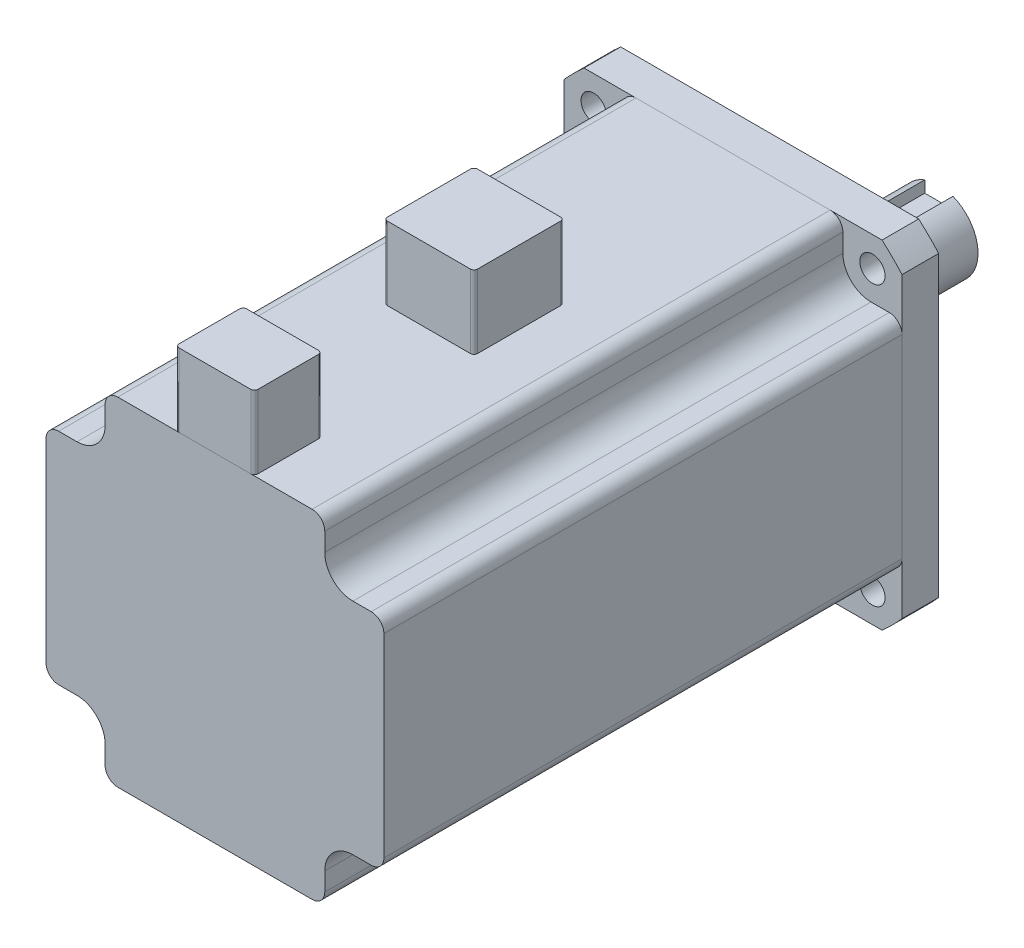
from build123d import *

# Parameters (mm, degrees)
SKETCH_1_R        = 2.25
EXTRUDE_1_DEPTH   = 6.5
SKETCH_2_R        = 25
EXTRUDE_2_DEPTH   = 3
EXTRUDE_3_DEPTH   = 27
EXTRUDE_4_DEPTH   = 92
EXTRUDE_5_DEPTH   = 13
EXTRUDE_5_2_DEPTH = 13


with BuildPart() as part:
    # Sketch 1 → Extrude 1 (new body)
    with BuildSketch(Plane.XY):
        with BuildLine():
            Line((-59.064382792, 2.814868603), (-111.979409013, 2.814868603))
            ThreePointArc((-111.979409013, 2.814868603), (-113.80616715, 1.099139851), (-115.521895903, -0.727618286))
            Line((-115.521895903, -0.727618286), (-115.521895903, -53.642644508))
            ThreePointArc((-115.521895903, -53.642644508), (-113.80616715, -55.469402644), (-111.979409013, -57.185131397))
            Line((-111.979409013, -57.185131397), (-59.064382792, -57.185131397))
            ThreePointArc((-59.064382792, -57.185131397), (-57.237624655, -55.469402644), (-55.521895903, -53.642644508))
            Line((-55.521895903, -53.642644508), (-55.521895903, -0.727618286))
            ThreePointArc((-55.521895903, -0.727618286), (-57.237624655, 1.099139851), (-59.064382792, 2.814868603))
        make_face()
        with Locations(Location((-110.270633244, -2.436394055, 0), (0, 0, 180))):
            Circle(SKETCH_1_R, mode=Mode.SUBTRACT)
        with Locations(Location((-60.773158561, -2.436394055, 0), (0, 0, 180))):
            Circle(SKETCH_1_R, mode=Mode.SUBTRACT)
        with Locations(Location((-60.773158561, -51.933868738, 0), (0, 0, 180))):
            Circle(SKETCH_1_R, mode=Mode.SUBTRACT)
        with Locations(Location((-110.270633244, -51.933868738, 0), (0, 0, 180))):
            Circle(SKETCH_1_R, mode=Mode.SUBTRACT)
    extrude(amount=EXTRUDE_1_DEPTH)

    # Sketch 2 → Extrude 2 (add)
    with BuildSketch(Plane(origin=(0, 0, 0), x_dir=(-1, 0, 0), z_dir=(0, 0, -1))):
        with Locations(Location((85.521895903, -27.185131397, 0), (0, 0, 180))):
            Circle(SKETCH_2_R)
    extrude(amount=EXTRUDE_2_DEPTH)

    # Sketch 3 → Extrude 3 (add)
    with BuildSketch(Plane(origin=(0, 0, -3), x_dir=(-1, 0, 0), z_dir=(0, 0, -1))):
        with BuildLine():
            Line((87.976441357, -20.629583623), (87.976441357, -22.685131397))
            Line((87.976441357, -22.685131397), (82.976441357, -22.685131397))
            Line((82.976441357, -22.685131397), (82.976441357, -20.664344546))
            ThreePointArc((82.976441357, -20.664344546), (85.570560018, -34.184962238), (87.976441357, -20.629583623))
        make_face()
    extrude(amount=EXTRUDE_3_DEPTH)


with BuildPart() as body_2:
    # Sketch 4 → Extrude 4 (new body)
    with BuildSketch(Plane.XY.offset(6.5)):
        with BuildLine():
            Line((-68.276175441, 2.814868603), (-102.767616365, 2.814868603))
            ThreePointArc((-102.767616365, 2.814868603), (-104.361632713, 2.154605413), (-105.021895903, 0.560589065))
            Line((-105.021895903, 0.560589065), (-105.021895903, -2.685131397))
            ThreePointArc((-105.021895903, -2.685131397), (-106.486361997, -6.220665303), (-110.021895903, -7.685131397))
            Line((-110.021895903, -7.685131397), (-113.267616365, -7.685131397))
            ThreePointArc((-113.267616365, -7.685131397), (-114.861632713, -8.345394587), (-115.521895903, -9.939410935))
            Line((-115.521895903, -9.939410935), (-115.521895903, -44.430851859))
            ThreePointArc((-115.521895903, -44.430851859), (-114.861632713, -46.024868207), (-113.267616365, -46.685131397))
            Line((-113.267616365, -46.685131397), (-110.021895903, -46.685131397))
            ThreePointArc((-110.021895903, -46.685131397), (-106.486361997, -48.149597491), (-105.021895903, -51.685131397))
            Line((-105.021895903, -51.685131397), (-105.021895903, -54.930851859))
            ThreePointArc((-105.021895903, -54.930851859), (-104.361632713, -56.524868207), (-102.767616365, -57.185131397))
            Line((-102.767616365, -57.185131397), (-68.276175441, -57.185131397))
            ThreePointArc((-68.276175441, -57.185131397), (-66.682159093, -56.524868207), (-66.021895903, -54.930851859))
            Line((-66.021895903, -54.930851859), (-66.021895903, -51.685131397))
            ThreePointArc((-66.021895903, -51.685131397), (-64.557429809, -48.149597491), (-61.021895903, -46.685131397))
            Line((-61.021895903, -46.685131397), (-57.776175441, -46.685131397))
            ThreePointArc((-57.776175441, -46.685131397), (-56.182159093, -46.024868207), (-55.521895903, -44.430851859))
            Line((-55.521895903, -44.430851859), (-55.521895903, -9.939410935))
            ThreePointArc((-55.521895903, -9.939410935), (-56.182159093, -8.345394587), (-57.776175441, -7.685131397))
            Line((-57.776175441, -7.685131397), (-61.021895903, -7.685131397))
            ThreePointArc((-61.021895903, -7.685131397), (-64.557429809, -6.220665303), (-66.021895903, -2.685131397))
            Line((-66.021895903, -2.685131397), (-66.021895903, 0.560589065))
            ThreePointArc((-66.021895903, 0.560589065), (-66.682159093, 2.154605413), (-68.276175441, 2.814868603))
        make_face()
    extrude(amount=EXTRUDE_4_DEPTH)


with BuildPart() as body_3:
    # Sketch 5 → Extrude 5 (new body)
    with BuildSketch(Plane(origin=(0, 2.814868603, 0), x_dir=(1, 0, 0), z_dir=(0, 1, 0))):
        with BuildLine():
            Line((-79.160412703, -86.5), (-91.883379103, -86.5))
            ThreePointArc((-91.883379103, -86.5), (-92.334878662, -86.687017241), (-92.521895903, -87.1385168))
            Line((-92.521895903, -87.1385168), (-92.521895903, -97.8614832))
            ThreePointArc((-92.521895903, -97.8614832), (-92.334878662, -98.312982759), (-91.883379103, -98.5))
            Line((-91.883379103, -98.5), (-79.160412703, -98.5))
            ThreePointArc((-79.160412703, -98.5), (-78.708913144, -98.312982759), (-78.521895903, -97.8614832))
            Line((-78.521895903, -97.8614832), (-78.521895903, -87.1385168))
            ThreePointArc((-78.521895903, -87.1385168), (-78.708913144, -86.687017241), (-79.160412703, -86.5))
        make_face()
    extrude(amount=EXTRUDE_5_DEPTH)


with BuildPart() as body_4:
    # Sketch 5 → Extrude 5 2 (new body)
    with BuildSketch(Plane(origin=(0, 2.814868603, 0), x_dir=(1, 0, 0), z_dir=(0, 1, 0))):
        with BuildLine():
            Line((-78.160412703, -44.5), (-92.883379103, -44.5))
            ThreePointArc((-92.883379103, -44.5), (-93.334878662, -44.687017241), (-93.521895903, -45.1385168))
            Line((-93.521895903, -45.1385168), (-93.521895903, -59.8614832))
            ThreePointArc((-93.521895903, -59.8614832), (-93.334878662, -60.312982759), (-92.883379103, -60.5))
            Line((-92.883379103, -60.5), (-78.160412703, -60.5))
            ThreePointArc((-78.160412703, -60.5), (-77.708913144, -60.312982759), (-77.521895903, -59.8614832))
            Line((-77.521895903, -59.8614832), (-77.521895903, -45.1385168))
            ThreePointArc((-77.521895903, -45.1385168), (-77.708913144, -44.687017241), (-78.160412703, -44.5))
        make_face()
    extrude(amount=EXTRUDE_5_2_DEPTH)


solid = Compound([part.part, body_2.part, body_3.part, body_4.part])
